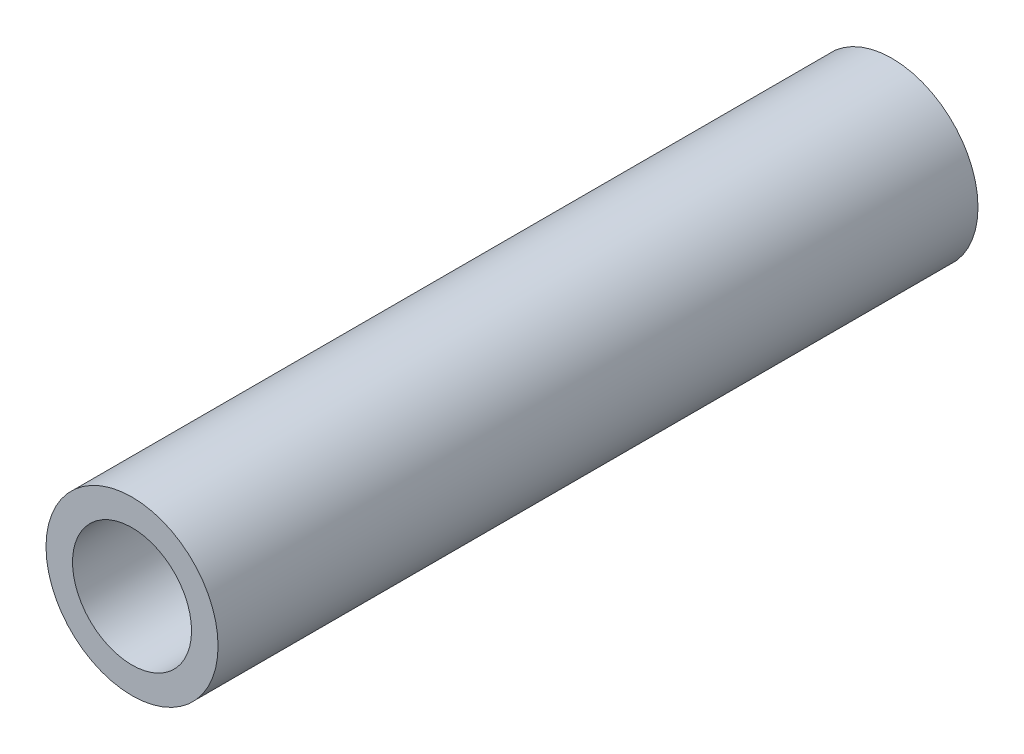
ISO-10303-21;
HEADER;
FILE_DESCRIPTION(('STEP AP214'),'2;1');
FILE_NAME('part.step','',(''),(''),'','','');
FILE_SCHEMA(('AUTOMOTIVE_DESIGN { 1 0 10303 214 1 1 1 1 }'));
ENDSEC;
DATA;
#1=APPLICATION_CONTEXT('core data for automotive mechanical design processes');
#2=APPLICATION_PROTOCOL_DEFINITION('international standard','automotive_design',2000,#1);
#3=PRODUCT_CONTEXT('',#1,'mechanical');
#4=PRODUCT('Part','Part','',(#3));
#5=PRODUCT_RELATED_PRODUCT_CATEGORY('part','',(#4));
#6=PRODUCT_DEFINITION_FORMATION('','',#4);
#7=PRODUCT_DEFINITION_CONTEXT('part definition',#1,'design');
#8=PRODUCT_DEFINITION('design','',#6,#7);
#9=PRODUCT_DEFINITION_SHAPE('','',#8);
#10=(LENGTH_UNIT() NAMED_UNIT(*) SI_UNIT(.MILLI.,.METRE.));
#11=(NAMED_UNIT(*) PLANE_ANGLE_UNIT() SI_UNIT($,.RADIAN.));
#12=(NAMED_UNIT(*) SI_UNIT($,.STERADIAN.) SOLID_ANGLE_UNIT());
#13=UNCERTAINTY_MEASURE_WITH_UNIT(LENGTH_MEASURE(1.E-05),#10,'distance_accuracy_value','');
#14=(GEOMETRIC_REPRESENTATION_CONTEXT(3) GLOBAL_UNCERTAINTY_ASSIGNED_CONTEXT((#13)) GLOBAL_UNIT_ASSIGNED_CONTEXT((#10,
#11,#12)) REPRESENTATION_CONTEXT('',''));
#15=CARTESIAN_POINT('',(0.,0.,0.));
#16=DIRECTION('',(0.,0.,1.));
#17=DIRECTION('',(1.,0.,0.));
#18=AXIS2_PLACEMENT_3D('',#15,#16,#17);
#19=CARTESIAN_POINT('',(190.,-9.9999999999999,26.5));
#20=DIRECTION('',(0.,0.,1.));
#21=DIRECTION('',(1.,0.,0.));
#22=AXIS2_PLACEMENT_3D('',#19,#20,#21);
#23=PLANE('',#22);
#24=CARTESIAN_POINT('',(190.,-9.9999999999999,26.5));
#25=DIRECTION('',(0.,0.,1.));
#26=DIRECTION('',(1.,0.,0.));
#27=AXIS2_PLACEMENT_3D('',#24,#25,#26);
#28=CIRCLE('',#27,6.00000000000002);
#29=CARTESIAN_POINT('',(196.,-9.9999999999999,26.5));
#30=VERTEX_POINT('',#29);
#31=EDGE_CURVE('E10',#30,#30,#28,.T.);
#32=ORIENTED_EDGE('',*,*,#31,.T.);
#33=EDGE_LOOP('',(#32));
#34=FACE_BOUND('',#33,.T.);
#35=CARTESIAN_POINT('',(190.,-9.9999999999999,26.5));
#36=DIRECTION('',(0.,0.,1.));
#37=DIRECTION('',(1.,0.,0.));
#38=AXIS2_PLACEMENT_3D('',#35,#36,#37);
#39=CIRCLE('',#38,4.14999999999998);
#40=CARTESIAN_POINT('',(194.15,-9.9999999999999,26.5));
#41=VERTEX_POINT('',#40);
#42=EDGE_CURVE('E43',#41,#41,#39,.T.);
#43=ORIENTED_EDGE('',*,*,#42,.F.);
#44=EDGE_LOOP('',(#43));
#45=FACE_BOUND('',#44,.T.);
#46=ADVANCED_FACE('F32',(#34,#45),#23,.T.);
#47=CARTESIAN_POINT('',(190.,-9.9999999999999,-26.5));
#48=DIRECTION('',(0.,0.,1.));
#49=DIRECTION('',(1.,0.,0.));
#50=AXIS2_PLACEMENT_3D('',#47,#48,#49);
#51=PLANE('',#50);
#52=CARTESIAN_POINT('',(190.,-9.9999999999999,-26.5));
#53=DIRECTION('',(0.,0.,1.));
#54=DIRECTION('',(1.,0.,0.));
#55=AXIS2_PLACEMENT_3D('',#52,#53,#54);
#56=CIRCLE('',#55,6.00000000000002);
#57=CARTESIAN_POINT('',(196.,-9.9999999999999,-26.5));
#58=VERTEX_POINT('',#57);
#59=EDGE_CURVE('E36',#58,#58,#56,.T.);
#60=ORIENTED_EDGE('',*,*,#59,.F.);
#61=EDGE_LOOP('',(#60));
#62=FACE_BOUND('',#61,.T.);
#63=CARTESIAN_POINT('',(190.,-9.9999999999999,-26.5));
#64=DIRECTION('',(0.,0.,1.));
#65=DIRECTION('',(1.,0.,0.));
#66=AXIS2_PLACEMENT_3D('',#63,#64,#65);
#67=CIRCLE('',#66,4.14999999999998);
#68=CARTESIAN_POINT('',(194.15,-9.9999999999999,-26.5));
#69=VERTEX_POINT('',#68);
#70=EDGE_CURVE('E45',#69,#69,#67,.T.);
#71=ORIENTED_EDGE('',*,*,#70,.T.);
#72=EDGE_LOOP('',(#71));
#73=FACE_BOUND('',#72,.T.);
#74=ADVANCED_FACE('F55',(#62,#73),#51,.F.);
#75=CARTESIAN_POINT('',(190.,-9.9999999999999,26.5));
#76=DIRECTION('',(0.,0.,-1.));
#77=DIRECTION('',(-1.,0.,0.));
#78=AXIS2_PLACEMENT_3D('',#75,#76,#77);
#79=CYLINDRICAL_SURFACE('',#78,6.00000000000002);
#80=ORIENTED_EDGE('',*,*,#31,.F.);
#81=EDGE_LOOP('',(#80));
#82=FACE_BOUND('',#81,.T.);
#83=ORIENTED_EDGE('',*,*,#59,.T.);
#84=EDGE_LOOP('',(#83));
#85=FACE_BOUND('',#84,.T.);
#86=ADVANCED_FACE('F34',(#82,#85),#79,.T.);
#87=CARTESIAN_POINT('',(190.,-9.9999999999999,26.5));
#88=DIRECTION('',(0.,0.,-1.));
#89=DIRECTION('',(-1.,0.,0.));
#90=AXIS2_PLACEMENT_3D('',#87,#88,#89);
#91=CYLINDRICAL_SURFACE('',#90,4.14999999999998);
#92=ORIENTED_EDGE('',*,*,#42,.T.);
#93=EDGE_LOOP('',(#92));
#94=FACE_BOUND('',#93,.T.);
#95=ORIENTED_EDGE('',*,*,#70,.F.);
#96=EDGE_LOOP('',(#95));
#97=FACE_BOUND('',#96,.T.);
#98=ADVANCED_FACE('F51',(#94,#97),#91,.F.);
#99=CLOSED_SHELL('',(#46,#74,#86,#98));
#100=MANIFOLD_SOLID_BREP('B2',#99);
#101=ADVANCED_BREP_SHAPE_REPRESENTATION('',(#18,#100),#14);
#102=SHAPE_DEFINITION_REPRESENTATION(#9,#101);
ENDSEC;
END-ISO-10303-21;
